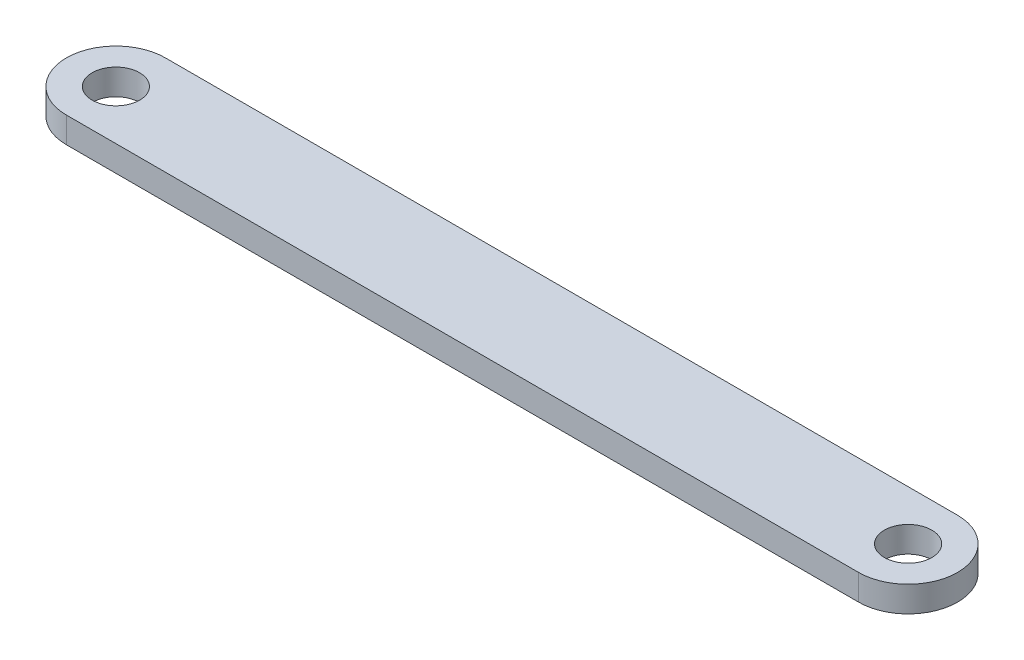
from build123d import *

# Parameters (mm, degrees)
SKETCH2_R           = 6
BOSS_EXTRUDE1_DEPTH = 6.5


with BuildPart() as part:
    # Sketch2 → Boss-Extrude1 (new body)
    with BuildSketch(Plane(origin=(0, 0, 0), x_dir=(1, 0, 0), z_dir=(0, 1, 0))):
        with BuildLine():
            Line((0, 12.5), (200, 12.5))
            ThreePointArc((200, 12.5), (212.5, 0), (200, -12.5))
            Line((200, -12.5), (0, -12.5))
            ThreePointArc((0, -12.5), (-12.5, 0), (0, 12.5))
        make_face()
        with Locations(Location((0, 0, 0), (0, 0, 90))):
            Circle(SKETCH2_R, mode=Mode.SUBTRACT)
        with Locations(Location((200, 0, 0), (0, 0, 90))):
            Circle(SKETCH2_R, mode=Mode.SUBTRACT)
    extrude(amount=BOSS_EXTRUDE1_DEPTH)


solid = part.part
